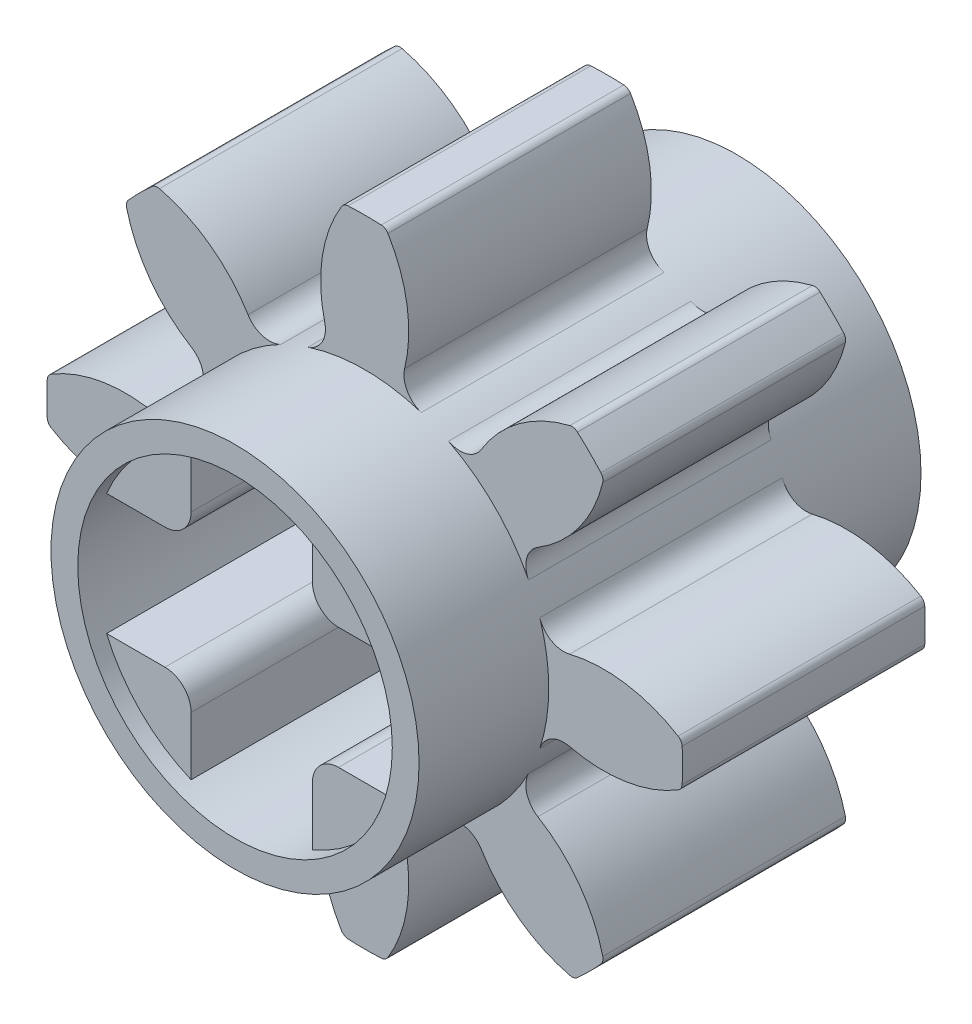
from build123d import *

# Parameters (mm, degrees)
SKETCH1_R                = 2.794
BASE_EXTRUDE_DEPTH       = 3.81
BOSS_EXTRUDE1_DEPTH      = 1.8415
FILLET1_R                = 0.127
FILLET2_R                = 0.381
CIRPATTERN2_COUNT        = 8
FILLET1_OF_CIRPATTERN2_R = 0.127
FILLET2_OF_CIRPATTERN2_R = 0.381
SKETCH3_R                = 2.3876
CUT_EXTRUDE1_DEPTH       = 11.229611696
BOSS_EXTRUDE2_DEPTH      = 7.62
FILLET3_R                = 0.396875
CIRPATTERN3_COUNT        = 4
FILLET3_OF_CIRPATTERN3_R = 0.396875
CUT_EXTRUDE2_START       = -0.254
SKETCH6_R                = 2.3876
CUT_EXTRUDE2_DEPTH       = 0.254
SKETCH7_R                = 2.3876
CUT_EXTRUDE3_DEPTH       = 0.254


with BuildPart() as part:
    # Sketch1 → Base-Extrude (new, symmetric)
    with BuildSketch(Plane.XY):
        with Locations(Location((0, 0, 0), (0, 0, 180))):
            Circle(SKETCH1_R)
    extrude(amount=BASE_EXTRUDE_DEPTH, both=True)

    # Sketch2 → Boss-Extrude1 (add, symmetric)
    with BuildSketch(Plane.XY):
        with BuildLine():
            ThreePointArc((0.485173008, 2.751552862), (0.661924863, 3.80471821), (0.3175, 4.815544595))
            ThreePointArc((0.3175, 4.815544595), (0, 4.826), (-0.3175, 4.815544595))
            ThreePointArc((-0.3175, 4.815544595), (-0.661924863, 3.80471821), (-0.485173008, 2.751552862))
            ThreePointArc((-0.485173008, 2.751552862), (0, 2.794), (0.485173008, 2.751552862))
        make_face()
    boss_extrude1 = extrude(amount=BOSS_EXTRUDE1_DEPTH, both=True)

    # Fillet1
    fillet1_edges = [part.edges().sort_by_distance(p)[0] for p in [
        (0.3175, 4.815544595, 0),
        (-0.3175, 4.815544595, 0),
    ]]
    fillet(fillet1_edges, radius=FILLET1_R)

    # Fillet2
    fillet2_edges = [part.edges().sort_by_distance(p)[0] for p in [
        (-0.485173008, 2.751552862, 0),
        (0.485173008, 2.751552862, 0),
    ]]
    fillet(fillet2_edges, radius=FILLET2_R)

    # CirPattern2: Boss-Extrude1 ×8 about axis
    cirpattern2_axis = Axis((0, 0, 0), (0, 0, 1))
    for i in range(1, CIRPATTERN2_COUNT):
        add(boss_extrude1.rotate(cirpattern2_axis, i * 360 / CIRPATTERN2_COUNT))

    # Fillet1 of CirPattern2
    fillet1_of_cirpattern2_edges = [part.edges().sort_by_distance(p)[0] for p in [
        (-3.180597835, 3.629610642, 0),
        (-3.629610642, 3.180597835, 0),
        (-4.815544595, 0.3175, 0),
        (-4.815544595, -0.3175, 0),
        (-3.629610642, -3.180597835, 0),
        (-3.180597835, -3.629610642, 0),
        (-0.3175, -4.815544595, 0),
        (0.3175, -4.815544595, 0),
        (3.180597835, -3.629610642, 0),
        (3.629610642, -3.180597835, 0),
        (4.815544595, -0.3175, 0),
        (4.815544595, 0.3175, 0),
        (3.629610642, 3.180597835, 0),
        (3.180597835, 3.629610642, 0),
    ]]
    fillet(fillet1_of_cirpattern2_edges, radius=FILLET1_OF_CIRPATTERN2_R)

    # Fillet2 of CirPattern2
    fillet2_of_cirpattern2_edges = [part.edges().sort_by_distance(p)[0] for p in [
        (-2.288710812, 1.602572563, 0),
        (-1.602572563, 2.288710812, 0),
        (-2.751552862, -0.485173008, 0),
        (-2.751552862, 0.485173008, 0),
        (-1.602572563, -2.288710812, 0),
        (-2.288710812, -1.602572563, 0),
        (0.485173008, -2.751552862, 0),
        (-0.485173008, -2.751552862, 0),
        (2.288710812, -1.602572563, 0),
        (1.602572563, -2.288710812, 0),
        (2.751552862, 0.485173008, 0),
        (2.751552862, -0.485173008, 0),
        (1.602572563, 2.288710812, 0),
        (2.288710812, 1.602572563, 0),
    ]]
    fillet(fillet2_of_cirpattern2_edges, radius=FILLET2_OF_CIRPATTERN2_R)

    # Sketch3 → Cut-Extrude1 (cut, through all)
    with BuildSketch(Plane.XY.offset(3.81)):
        Circle(SKETCH3_R)
    extrude(amount=-CUT_EXTRUDE1_DEPTH, mode=Mode.SUBTRACT)

    # Sketch5 → Boss-Extrude2 (add, through all)
    with BuildSketch(Plane(origin=(0, 0, -3.81), x_dir=(-1, 0, 0), z_dir=(0, 0, -1))):
        with BuildLine():
            Line((-0.92075, -2.202919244), (-0.92075, -0.92075))
            Line((-0.92075, -0.92075), (-2.202919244, -0.92075))
            ThreePointArc((-2.202919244, -0.92075), (-1.688288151, -1.688288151), (-0.92075, -2.202919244))
        make_face()
    boss_extrude2 = extrude(amount=-BOSS_EXTRUDE2_DEPTH)

    # Fillet3
    fillet3_edges = [part.edges().sort_by_distance(p)[0] for p in [
        (0.92075, -0.92075, 0),
    ]]
    fillet(fillet3_edges, radius=FILLET3_R)

    # CirPattern3: Boss-Extrude2 ×4 about axis
    cirpattern3_axis = Axis((0, 0, 0), (0, 0, 1))
    for i in range(1, CIRPATTERN3_COUNT):
        add(boss_extrude2.rotate(cirpattern3_axis, i * 360 / CIRPATTERN3_COUNT))

    # Fillet3 of CirPattern3
    fillet3_of_cirpattern3_edges = [part.edges().sort_by_distance(p)[0] for p in [
        (0.92075, 0.92075, 0),
        (-0.92075, 0.92075, 0),
        (-0.92075, -0.92075, 0),
    ]]
    fillet(fillet3_of_cirpattern3_edges, radius=FILLET3_OF_CIRPATTERN3_R)

    # Sketch6 → Cut-Extrude2 (cut)
    with BuildSketch(Plane(origin=(0, 0, -3.81), x_dir=(-1, 0, 0), z_dir=(0, 0, -1)).offset(CUT_EXTRUDE2_START)):
        with Locations(Location((0, 0, 0), (0, 0, 180))):
            Circle(SKETCH6_R)
    extrude(amount=CUT_EXTRUDE2_DEPTH, mode=Mode.SUBTRACT)

    # Sketch7 → Cut-Extrude3 (cut)
    with BuildSketch(Plane.XY.offset(3.81)):
        Circle(SKETCH7_R)
    extrude(amount=-CUT_EXTRUDE3_DEPTH, mode=Mode.SUBTRACT)


solid = part.part
